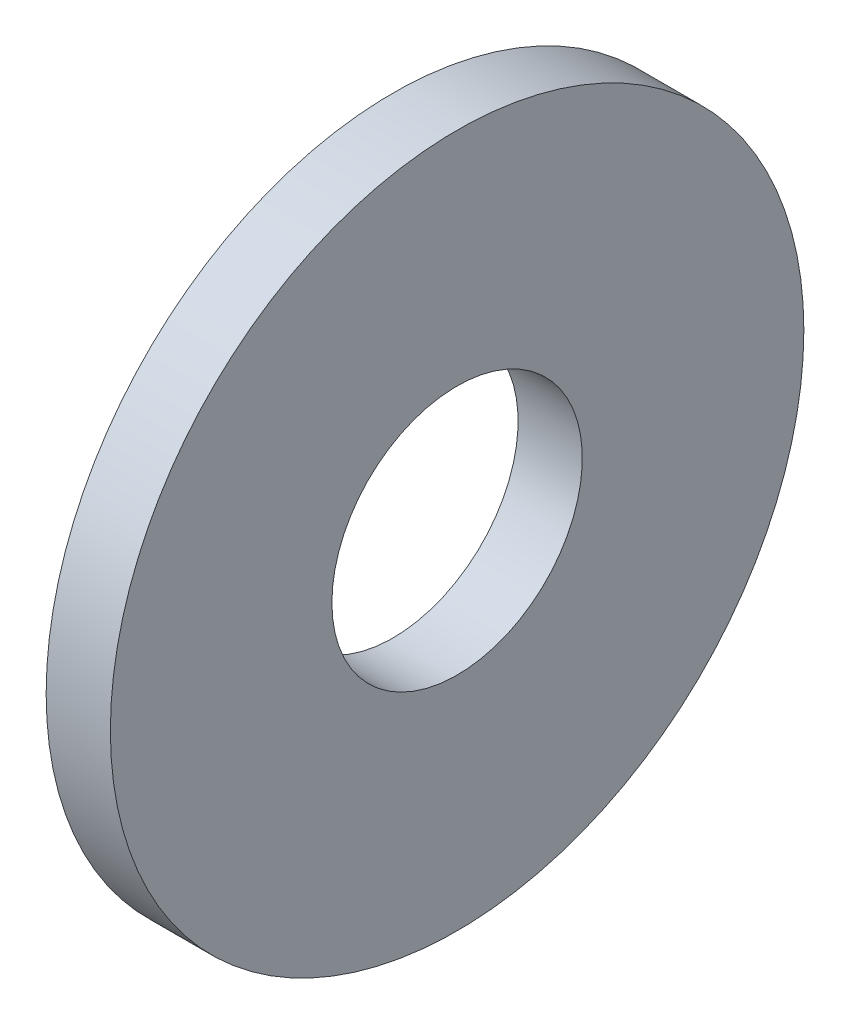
ISO-10303-21;
HEADER;
FILE_DESCRIPTION(('STEP AP214'),'2;1');
FILE_NAME('part.step','',(''),(''),'','','');
FILE_SCHEMA(('AUTOMOTIVE_DESIGN { 1 0 10303 214 1 1 1 1 }'));
ENDSEC;
DATA;
#1=APPLICATION_CONTEXT('core data for automotive mechanical design processes');
#2=APPLICATION_PROTOCOL_DEFINITION('international standard','automotive_design',2000,#1);
#3=PRODUCT_CONTEXT('',#1,'mechanical');
#4=PRODUCT('Part','Part','',(#3));
#5=PRODUCT_RELATED_PRODUCT_CATEGORY('part','',(#4));
#6=PRODUCT_DEFINITION_FORMATION('','',#4);
#7=PRODUCT_DEFINITION_CONTEXT('part definition',#1,'design');
#8=PRODUCT_DEFINITION('design','',#6,#7);
#9=PRODUCT_DEFINITION_SHAPE('','',#8);
#10=(LENGTH_UNIT() NAMED_UNIT(*) SI_UNIT(.MILLI.,.METRE.));
#11=(NAMED_UNIT(*) PLANE_ANGLE_UNIT() SI_UNIT($,.RADIAN.));
#12=(NAMED_UNIT(*) SI_UNIT($,.STERADIAN.) SOLID_ANGLE_UNIT());
#13=UNCERTAINTY_MEASURE_WITH_UNIT(LENGTH_MEASURE(1.E-05),#10,'distance_accuracy_value','');
#14=(GEOMETRIC_REPRESENTATION_CONTEXT(3) GLOBAL_UNCERTAINTY_ASSIGNED_CONTEXT((#13)) GLOBAL_UNIT_ASSIGNED_CONTEXT((#10,
#11,#12)) REPRESENTATION_CONTEXT('',''));
#15=CARTESIAN_POINT('',(0.,0.,0.));
#16=DIRECTION('',(0.,0.,1.));
#17=DIRECTION('',(1.,0.,0.));
#18=AXIS2_PLACEMENT_3D('',#15,#16,#17);
#19=CARTESIAN_POINT('',(-34.9249999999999,0.,0.));
#20=DIRECTION('',(-1.,0.,0.));
#21=DIRECTION('',(0.,0.,1.));
#22=AXIS2_PLACEMENT_3D('',#19,#20,#21);
#23=CYLINDRICAL_SURFACE('',#22,19.5);
#24=CARTESIAN_POINT('',(0.,0.,0.));
#25=DIRECTION('',(-1.,0.,0.));
#26=DIRECTION('',(0.,0.,1.));
#27=AXIS2_PLACEMENT_3D('',#24,#25,#26);
#28=CIRCLE('',#27,19.5);
#29=CARTESIAN_POINT('',(0.,0.,19.5));
#30=VERTEX_POINT('',#29);
#31=EDGE_CURVE('E10',#30,#30,#28,.T.);
#32=ORIENTED_EDGE('',*,*,#31,.F.);
#33=EDGE_LOOP('',(#32));
#34=FACE_BOUND('',#33,.T.);
#35=CARTESIAN_POINT('',(-10.,0.,0.));
#36=DIRECTION('',(-1.,0.,0.));
#37=DIRECTION('',(0.,0.,1.));
#38=AXIS2_PLACEMENT_3D('',#35,#36,#37);
#39=CIRCLE('',#38,19.5);
#40=CARTESIAN_POINT('',(-10.,0.,19.5));
#41=VERTEX_POINT('',#40);
#42=EDGE_CURVE('E44',#41,#41,#39,.T.);
#43=ORIENTED_EDGE('',*,*,#42,.T.);
#44=EDGE_LOOP('',(#43));
#45=FACE_BOUND('',#44,.T.);
#46=ADVANCED_FACE('F30',(#34,#45),#23,.F.);
#47=CARTESIAN_POINT('',(0.,19.5,0.));
#48=DIRECTION('',(-1.,0.,0.));
#49=DIRECTION('',(0.,0.,1.));
#50=AXIS2_PLACEMENT_3D('',#47,#48,#49);
#51=PLANE('',#50);
#52=CARTESIAN_POINT('',(0.,0.,0.));
#53=DIRECTION('',(-1.,0.,0.));
#54=DIRECTION('',(0.,0.,1.));
#55=AXIS2_PLACEMENT_3D('',#52,#53,#54);
#56=CIRCLE('',#55,54.);
#57=CARTESIAN_POINT('',(0.,0.,54.));
#58=VERTEX_POINT('',#57);
#59=EDGE_CURVE('E36',#58,#58,#56,.T.);
#60=ORIENTED_EDGE('',*,*,#59,.F.);
#61=EDGE_LOOP('',(#60));
#62=FACE_BOUND('',#61,.T.);
#63=ORIENTED_EDGE('',*,*,#31,.T.);
#64=EDGE_LOOP('',(#63));
#65=FACE_BOUND('',#64,.T.);
#66=ADVANCED_FACE('F59',(#62,#65),#51,.F.);
#67=CARTESIAN_POINT('',(-34.9249999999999,0.,0.));
#68=DIRECTION('',(-1.,0.,0.));
#69=DIRECTION('',(0.,0.,1.));
#70=AXIS2_PLACEMENT_3D('',#67,#68,#69);
#71=CYLINDRICAL_SURFACE('',#70,54.);
#72=CARTESIAN_POINT('',(-10.,0.,0.));
#73=DIRECTION('',(-1.,0.,0.));
#74=DIRECTION('',(0.,0.,1.));
#75=AXIS2_PLACEMENT_3D('',#72,#73,#74);
#76=CIRCLE('',#75,54.);
#77=CARTESIAN_POINT('',(-10.,0.,54.));
#78=VERTEX_POINT('',#77);
#79=EDGE_CURVE('E40',#78,#78,#76,.T.);
#80=ORIENTED_EDGE('',*,*,#79,.F.);
#81=EDGE_LOOP('',(#80));
#82=FACE_BOUND('',#81,.T.);
#83=ORIENTED_EDGE('',*,*,#59,.T.);
#84=EDGE_LOOP('',(#83));
#85=FACE_BOUND('',#84,.T.);
#86=ADVANCED_FACE('F54',(#82,#85),#71,.T.);
#87=CARTESIAN_POINT('',(-10.,54.,0.));
#88=DIRECTION('',(1.,0.,0.));
#89=DIRECTION('',(0.,0.,-1.));
#90=AXIS2_PLACEMENT_3D('',#87,#88,#89);
#91=PLANE('',#90);
#92=ORIENTED_EDGE('',*,*,#42,.F.);
#93=EDGE_LOOP('',(#92));
#94=FACE_BOUND('',#93,.T.);
#95=ORIENTED_EDGE('',*,*,#79,.T.);
#96=EDGE_LOOP('',(#95));
#97=FACE_BOUND('',#96,.T.);
#98=ADVANCED_FACE('F51',(#94,#97),#91,.F.);
#99=CLOSED_SHELL('',(#46,#66,#86,#98));
#100=MANIFOLD_SOLID_BREP('B2',#99);
#101=ADVANCED_BREP_SHAPE_REPRESENTATION('',(#18,#100),#14);
#102=SHAPE_DEFINITION_REPRESENTATION(#9,#101);
ENDSEC;
END-ISO-10303-21;
